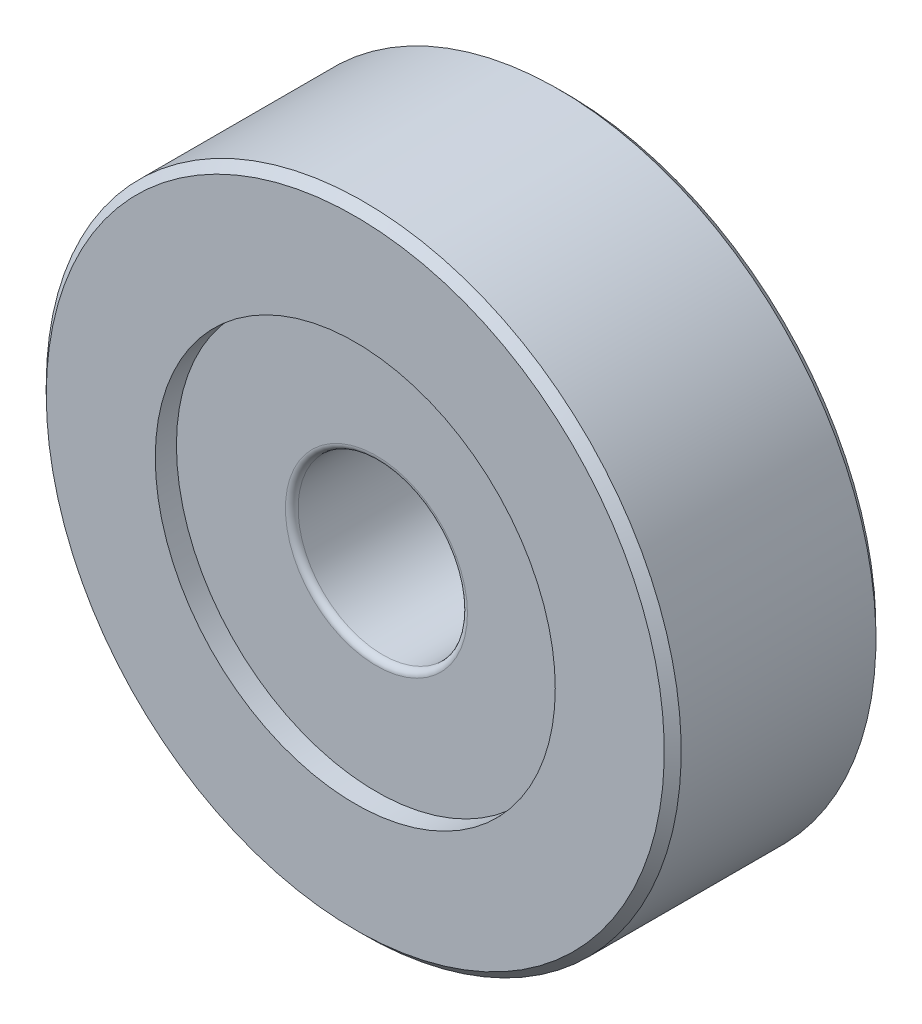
ISO-10303-21;
HEADER;
FILE_DESCRIPTION(('STEP AP214'),'2;1');
FILE_NAME('part.step','',(''),(''),'','','');
FILE_SCHEMA(('AUTOMOTIVE_DESIGN { 1 0 10303 214 1 1 1 1 }'));
ENDSEC;
DATA;
#1=APPLICATION_CONTEXT('core data for automotive mechanical design processes');
#2=APPLICATION_PROTOCOL_DEFINITION('international standard','automotive_design',2000,#1);
#3=PRODUCT_CONTEXT('',#1,'mechanical');
#4=PRODUCT('Part','Part','',(#3));
#5=PRODUCT_RELATED_PRODUCT_CATEGORY('part','',(#4));
#6=PRODUCT_DEFINITION_FORMATION('','',#4);
#7=PRODUCT_DEFINITION_CONTEXT('part definition',#1,'design');
#8=PRODUCT_DEFINITION('design','',#6,#7);
#9=PRODUCT_DEFINITION_SHAPE('','',#8);
#10=(LENGTH_UNIT() NAMED_UNIT(*) SI_UNIT(.MILLI.,.METRE.));
#11=(NAMED_UNIT(*) PLANE_ANGLE_UNIT() SI_UNIT($,.RADIAN.));
#12=(NAMED_UNIT(*) SI_UNIT($,.STERADIAN.) SOLID_ANGLE_UNIT());
#13=UNCERTAINTY_MEASURE_WITH_UNIT(LENGTH_MEASURE(1.E-05),#10,'distance_accuracy_value','');
#14=(GEOMETRIC_REPRESENTATION_CONTEXT(3) GLOBAL_UNCERTAINTY_ASSIGNED_CONTEXT((#13)) GLOBAL_UNIT_ASSIGNED_CONTEXT((#10,
#11,#12)) REPRESENTATION_CONTEXT('',''));
#15=CARTESIAN_POINT('',(0.,0.,0.));
#16=DIRECTION('',(0.,0.,1.));
#17=DIRECTION('',(1.,0.,0.));
#18=AXIS2_PLACEMENT_3D('',#15,#16,#17);
#19=CARTESIAN_POINT('',(0.,0.,1.85));
#20=DIRECTION('',(0.,0.,1.));
#21=DIRECTION('',(1.,0.,0.));
#22=AXIS2_PLACEMENT_3D('',#19,#20,#21);
#23=TOROIDAL_SURFACE('',#22,2.15,0.150000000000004);
#24=CARTESIAN_POINT('',(0.,0.,1.85000000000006));
#25=DIRECTION('',(0.,0.,1.));
#26=DIRECTION('',(1.,0.,0.));
#27=AXIS2_PLACEMENT_3D('',#24,#25,#26);
#28=CIRCLE('',#27,2.);
#29=CARTESIAN_POINT('',(2.,0.,1.85000000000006));
#30=VERTEX_POINT('',#29);
#31=EDGE_CURVE('E8',#30,#30,#28,.T.);
#32=ORIENTED_EDGE('',*,*,#31,.F.);
#33=EDGE_LOOP('',(#32));
#34=FACE_BOUND('',#33,.T.);
#35=CARTESIAN_POINT('',(0.,0.,2.));
#36=DIRECTION('',(0.,0.,1.));
#37=DIRECTION('',(1.,0.,0.));
#38=AXIS2_PLACEMENT_3D('',#35,#36,#37);
#39=CIRCLE('',#38,2.15);
#40=CARTESIAN_POINT('',(2.15,0.,2.));
#41=VERTEX_POINT('',#40);
#42=EDGE_CURVE('E40',#41,#41,#39,.T.);
#43=ORIENTED_EDGE('',*,*,#42,.T.);
#44=EDGE_LOOP('',(#43));
#45=FACE_BOUND('',#44,.T.);
#46=ADVANCED_FACE('F12',(#34,#45),#23,.T.);
#47=CARTESIAN_POINT('',(0.,0.,5.5));
#48=DIRECTION('',(0.,0.,1.));
#49=DIRECTION('',(1.,0.,0.));
#50=AXIS2_PLACEMENT_3D('',#47,#48,#49);
#51=CYLINDRICAL_SURFACE('',#50,2.);
#52=CARTESIAN_POINT('',(0.,0.,-1.84999999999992));
#53=DIRECTION('',(0.,0.,1.));
#54=DIRECTION('',(1.,0.,0.));
#55=AXIS2_PLACEMENT_3D('',#52,#53,#54);
#56=CIRCLE('',#55,2.);
#57=CARTESIAN_POINT('',(2.,0.,-1.84999999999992));
#58=VERTEX_POINT('',#57);
#59=EDGE_CURVE('E18',#58,#58,#56,.T.);
#60=ORIENTED_EDGE('',*,*,#59,.F.);
#61=EDGE_LOOP('',(#60));
#62=FACE_BOUND('',#61,.T.);
#63=ORIENTED_EDGE('',*,*,#31,.T.);
#64=EDGE_LOOP('',(#63));
#65=FACE_BOUND('',#64,.T.);
#66=ADVANCED_FACE('F72',(#62,#65),#51,.F.);
#67=CARTESIAN_POINT('',(0.,0.,-1.84999999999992));
#68=DIRECTION('',(0.,0.,1.));
#69=DIRECTION('',(1.,0.,0.));
#70=AXIS2_PLACEMENT_3D('',#67,#68,#69);
#71=TOROIDAL_SURFACE('',#70,2.15,0.149999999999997);
#72=CARTESIAN_POINT('',(0.,0.,-1.99999999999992));
#73=DIRECTION('',(0.,0.,1.));
#74=DIRECTION('',(1.,0.,0.));
#75=AXIS2_PLACEMENT_3D('',#72,#73,#74);
#76=CIRCLE('',#75,2.15);
#77=CARTESIAN_POINT('',(2.15,0.,-1.99999999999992));
#78=VERTEX_POINT('',#77);
#79=EDGE_CURVE('E22',#78,#78,#76,.T.);
#80=ORIENTED_EDGE('',*,*,#79,.F.);
#81=EDGE_LOOP('',(#80));
#82=FACE_BOUND('',#81,.T.);
#83=ORIENTED_EDGE('',*,*,#59,.T.);
#84=EDGE_LOOP('',(#83));
#85=FACE_BOUND('',#84,.T.);
#86=ADVANCED_FACE('F77',(#82,#85),#71,.T.);
#87=CARTESIAN_POINT('',(0.,2.15,-1.99999999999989));
#88=DIRECTION('',(0.,0.,1.));
#89=DIRECTION('',(1.,0.,0.));
#90=AXIS2_PLACEMENT_3D('',#87,#88,#89);
#91=PLANE('',#90);
#92=CARTESIAN_POINT('',(0.,0.,-1.99999999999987));
#93=DIRECTION('',(0.,0.,1.));
#94=DIRECTION('',(1.,0.,0.));
#95=AXIS2_PLACEMENT_3D('',#92,#93,#94);
#96=CIRCLE('',#95,4.725);
#97=CARTESIAN_POINT('',(4.725,0.,-1.99999999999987));
#98=VERTEX_POINT('',#97);
#99=EDGE_CURVE('E26',#98,#98,#96,.T.);
#100=ORIENTED_EDGE('',*,*,#99,.F.);
#101=EDGE_LOOP('',(#100));
#102=FACE_BOUND('',#101,.T.);
#103=ORIENTED_EDGE('',*,*,#79,.T.);
#104=EDGE_LOOP('',(#103));
#105=FACE_BOUND('',#104,.T.);
#106=ADVANCED_FACE('F114',(#102,#105),#91,.F.);
#107=CARTESIAN_POINT('',(0.,0.,5.5));
#108=DIRECTION('',(0.,0.,1.));
#109=DIRECTION('',(1.,0.,0.));
#110=AXIS2_PLACEMENT_3D('',#107,#108,#109);
#111=CYLINDRICAL_SURFACE('',#110,4.725);
#112=CARTESIAN_POINT('',(0.,0.,-2.5));
#113=DIRECTION('',(0.,0.,1.));
#114=DIRECTION('',(1.,0.,0.));
#115=AXIS2_PLACEMENT_3D('',#112,#113,#114);
#116=CIRCLE('',#115,4.725);
#117=CARTESIAN_POINT('',(4.725,0.,-2.5));
#118=VERTEX_POINT('',#117);
#119=EDGE_CURVE('E31',#118,#118,#116,.T.);
#120=ORIENTED_EDGE('',*,*,#119,.F.);
#121=EDGE_LOOP('',(#120));
#122=FACE_BOUND('',#121,.T.);
#123=ORIENTED_EDGE('',*,*,#99,.T.);
#124=EDGE_LOOP('',(#123));
#125=FACE_BOUND('',#124,.T.);
#126=ADVANCED_FACE('F111',(#122,#125),#111,.F.);
#127=CARTESIAN_POINT('',(0.,6.8,-2.5));
#128=DIRECTION('',(0.,0.,1.));
#129=DIRECTION('',(1.,0.,0.));
#130=AXIS2_PLACEMENT_3D('',#127,#128,#129);
#131=PLANE('',#130);
#132=CARTESIAN_POINT('',(0.,0.,-2.5));
#133=DIRECTION('',(0.,0.,-1.));
#134=DIRECTION('',(-1.,0.,0.));
#135=AXIS2_PLACEMENT_3D('',#132,#133,#134);
#136=CIRCLE('',#135,7.3);
#137=CARTESIAN_POINT('',(-7.3,0.,-2.5));
#138=VERTEX_POINT('',#137);
#139=EDGE_CURVE('E52',#138,#138,#136,.T.);
#140=ORIENTED_EDGE('',*,*,#139,.T.);
#141=EDGE_LOOP('',(#140));
#142=FACE_BOUND('',#141,.T.);
#143=ORIENTED_EDGE('',*,*,#119,.T.);
#144=EDGE_LOOP('',(#143));
#145=FACE_BOUND('',#144,.T.);
#146=ADVANCED_FACE('F56',(#142,#145),#131,.F.);
#147=CARTESIAN_POINT('',(0.,6.8,2.5));
#148=DIRECTION('',(0.,0.,-1.));
#149=DIRECTION('',(-1.,0.,0.));
#150=AXIS2_PLACEMENT_3D('',#147,#148,#149);
#151=PLANE('',#150);
#152=CARTESIAN_POINT('',(0.,0.,2.5));
#153=DIRECTION('',(0.,0.,1.));
#154=DIRECTION('',(1.,0.,0.));
#155=AXIS2_PLACEMENT_3D('',#152,#153,#154);
#156=CIRCLE('',#155,4.725);
#157=CARTESIAN_POINT('',(4.725,0.,2.5));
#158=VERTEX_POINT('',#157);
#159=EDGE_CURVE('E34',#158,#158,#156,.T.);
#160=ORIENTED_EDGE('',*,*,#159,.F.);
#161=EDGE_LOOP('',(#160));
#162=FACE_BOUND('',#161,.T.);
#163=CARTESIAN_POINT('',(0.,0.,2.5));
#164=DIRECTION('',(0.,0.,-1.));
#165=DIRECTION('',(-1.,0.,0.));
#166=AXIS2_PLACEMENT_3D('',#163,#164,#165);
#167=CIRCLE('',#166,7.3);
#168=CARTESIAN_POINT('',(-7.3,0.,2.5));
#169=VERTEX_POINT('',#168);
#170=EDGE_CURVE('E43',#169,#169,#167,.T.);
#171=ORIENTED_EDGE('',*,*,#170,.F.);
#172=EDGE_LOOP('',(#171));
#173=FACE_BOUND('',#172,.T.);
#174=ADVANCED_FACE('F91',(#162,#173),#151,.F.);
#175=CARTESIAN_POINT('',(0.,0.,5.5));
#176=DIRECTION('',(0.,0.,1.));
#177=DIRECTION('',(1.,0.,0.));
#178=AXIS2_PLACEMENT_3D('',#175,#176,#177);
#179=CYLINDRICAL_SURFACE('',#178,4.725);
#180=CARTESIAN_POINT('',(0.,0.,2.));
#181=DIRECTION('',(0.,0.,1.));
#182=DIRECTION('',(1.,0.,0.));
#183=AXIS2_PLACEMENT_3D('',#180,#181,#182);
#184=CIRCLE('',#183,4.725);
#185=CARTESIAN_POINT('',(4.725,0.,2.));
#186=VERTEX_POINT('',#185);
#187=EDGE_CURVE('E37',#186,#186,#184,.T.);
#188=ORIENTED_EDGE('',*,*,#187,.F.);
#189=EDGE_LOOP('',(#188));
#190=FACE_BOUND('',#189,.T.);
#191=ORIENTED_EDGE('',*,*,#159,.T.);
#192=EDGE_LOOP('',(#191));
#193=FACE_BOUND('',#192,.T.);
#194=ADVANCED_FACE('F85',(#190,#193),#179,.F.);
#195=CARTESIAN_POINT('',(0.,4.725,2.));
#196=DIRECTION('',(0.,0.,-1.));
#197=DIRECTION('',(-1.,0.,0.));
#198=AXIS2_PLACEMENT_3D('',#195,#196,#197);
#199=PLANE('',#198);
#200=ORIENTED_EDGE('',*,*,#42,.F.);
#201=EDGE_LOOP('',(#200));
#202=FACE_BOUND('',#201,.T.);
#203=ORIENTED_EDGE('',*,*,#187,.T.);
#204=EDGE_LOOP('',(#203));
#205=FACE_BOUND('',#204,.T.);
#206=ADVANCED_FACE('F82',(#202,#205),#199,.F.);
#207=CARTESIAN_POINT('',(0.,0.,2.3));
#208=DIRECTION('',(0.,0.,-1.));
#209=DIRECTION('',(-1.,0.,0.));
#210=AXIS2_PLACEMENT_3D('',#207,#208,#209);
#211=CONICAL_SURFACE('',#210,7.5,0.785398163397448);
#212=ORIENTED_EDGE('',*,*,#170,.T.);
#213=EDGE_LOOP('',(#212));
#214=FACE_BOUND('',#213,.T.);
#215=CARTESIAN_POINT('',(0.,0.,2.3));
#216=DIRECTION('',(0.,0.,-1.));
#217=DIRECTION('',(-1.,0.,0.));
#218=AXIS2_PLACEMENT_3D('',#215,#216,#217);
#219=CIRCLE('',#218,7.5);
#220=CARTESIAN_POINT('',(-7.5,0.,2.3));
#221=VERTEX_POINT('',#220);
#222=EDGE_CURVE('E46',#221,#221,#219,.T.);
#223=ORIENTED_EDGE('',*,*,#222,.F.);
#224=EDGE_LOOP('',(#223));
#225=FACE_BOUND('',#224,.T.);
#226=ADVANCED_FACE('F68',(#214,#225),#211,.T.);
#227=CARTESIAN_POINT('',(0.,0.,0.633406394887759));
#228=DIRECTION('',(0.,0.,-1.));
#229=DIRECTION('',(-1.,0.,0.));
#230=AXIS2_PLACEMENT_3D('',#227,#228,#229);
#231=CYLINDRICAL_SURFACE('',#230,7.5);
#232=ORIENTED_EDGE('',*,*,#222,.T.);
#233=EDGE_LOOP('',(#232));
#234=FACE_BOUND('',#233,.T.);
#235=CARTESIAN_POINT('',(0.,0.,-2.3));
#236=DIRECTION('',(0.,0.,-1.));
#237=DIRECTION('',(-1.,0.,0.));
#238=AXIS2_PLACEMENT_3D('',#235,#236,#237);
#239=CIRCLE('',#238,7.5);
#240=CARTESIAN_POINT('',(-7.5,0.,-2.3));
#241=VERTEX_POINT('',#240);
#242=EDGE_CURVE('E49',#241,#241,#239,.T.);
#243=ORIENTED_EDGE('',*,*,#242,.F.);
#244=EDGE_LOOP('',(#243));
#245=FACE_BOUND('',#244,.T.);
#246=ADVANCED_FACE('F61',(#234,#245),#231,.T.);
#247=CARTESIAN_POINT('',(0.,0.,-2.5));
#248=DIRECTION('',(0.,0.,1.));
#249=DIRECTION('',(1.,0.,0.));
#250=AXIS2_PLACEMENT_3D('',#247,#248,#249);
#251=CONICAL_SURFACE('',#250,7.3,0.785398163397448);
#252=ORIENTED_EDGE('',*,*,#242,.T.);
#253=EDGE_LOOP('',(#252));
#254=FACE_BOUND('',#253,.T.);
#255=ORIENTED_EDGE('',*,*,#139,.F.);
#256=EDGE_LOOP('',(#255));
#257=FACE_BOUND('',#256,.T.);
#258=ADVANCED_FACE('F59',(#254,#257),#251,.T.);
#259=CLOSED_SHELL('',(#46,#66,#86,#106,#126,#146,#174,#194,#206,#226,#246,#258));
#260=MANIFOLD_SOLID_BREP('B1',#259);
#261=ADVANCED_BREP_SHAPE_REPRESENTATION('',(#18,#260),#14);
#262=SHAPE_DEFINITION_REPRESENTATION(#9,#261);
ENDSEC;
END-ISO-10303-21;
